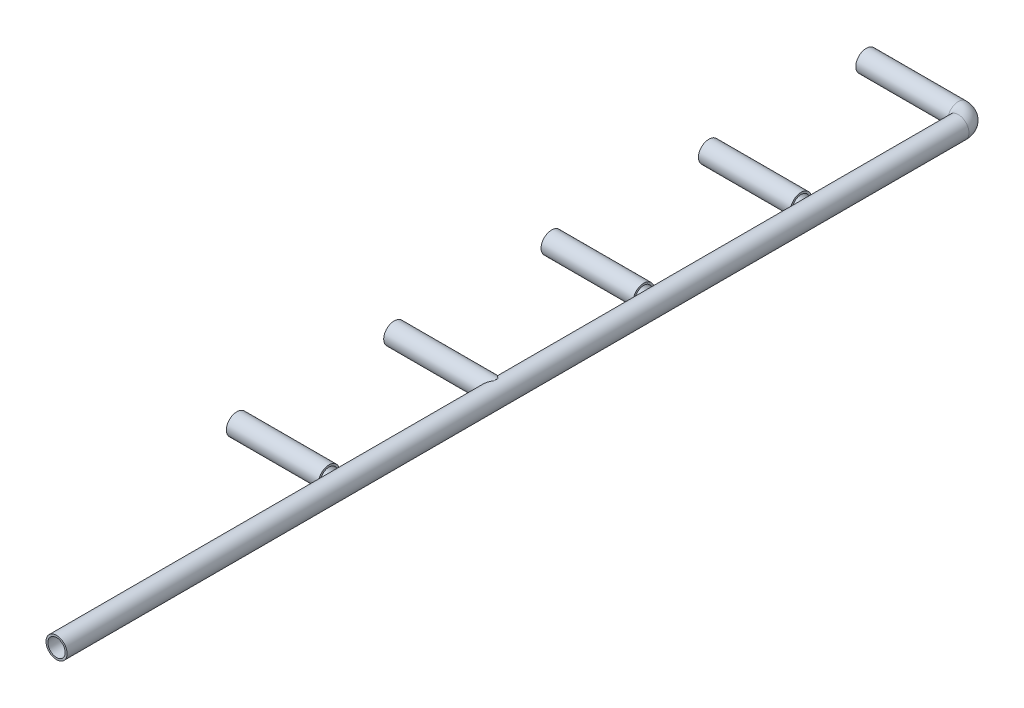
ISO-10303-21;
HEADER;
FILE_DESCRIPTION(('STEP AP214'),'2;1');
FILE_NAME('part.step','',(''),(''),'','','');
FILE_SCHEMA(('AUTOMOTIVE_DESIGN { 1 0 10303 214 1 1 1 1 }'));
ENDSEC;
DATA;
#1=APPLICATION_CONTEXT('core data for automotive mechanical design processes');
#2=APPLICATION_PROTOCOL_DEFINITION('international standard','automotive_design',2000,#1);
#3=PRODUCT_CONTEXT('',#1,'mechanical');
#4=PRODUCT('Part','Part','',(#3));
#5=PRODUCT_RELATED_PRODUCT_CATEGORY('part','',(#4));
#6=PRODUCT_DEFINITION_FORMATION('','',#4);
#7=PRODUCT_DEFINITION_CONTEXT('part definition',#1,'design');
#8=PRODUCT_DEFINITION('design','',#6,#7);
#9=PRODUCT_DEFINITION_SHAPE('','',#8);
#10=(LENGTH_UNIT() NAMED_UNIT(*) SI_UNIT(.MILLI.,.METRE.));
#11=(NAMED_UNIT(*) PLANE_ANGLE_UNIT() SI_UNIT($,.RADIAN.));
#12=(NAMED_UNIT(*) SI_UNIT($,.STERADIAN.) SOLID_ANGLE_UNIT());
#13=UNCERTAINTY_MEASURE_WITH_UNIT(LENGTH_MEASURE(1.E-05),#10,'distance_accuracy_value','');
#14=(GEOMETRIC_REPRESENTATION_CONTEXT(3) GLOBAL_UNCERTAINTY_ASSIGNED_CONTEXT((#13)) GLOBAL_UNIT_ASSIGNED_CONTEXT((#10,
#11,#12)) REPRESENTATION_CONTEXT('',''));
#15=CARTESIAN_POINT('',(0.,0.,0.));
#16=DIRECTION('',(0.,0.,1.));
#17=DIRECTION('',(1.,0.,0.));
#18=AXIS2_PLACEMENT_3D('',#15,#16,#17);
#19=CARTESIAN_POINT('',(-48.,0.,-82.));
#20=DIRECTION('',(1.,0.,0.));
#21=DIRECTION('',(0.,0.,-1.));
#22=AXIS2_PLACEMENT_3D('',#19,#20,#21);
#23=CYLINDRICAL_SURFACE('',#22,4.5);
#24=CARTESIAN_POINT('',(-48.,0.,-82.));
#25=DIRECTION('',(1.,0.,0.));
#26=DIRECTION('',(0.,0.,-1.));
#27=AXIS2_PLACEMENT_3D('',#24,#25,#26);
#28=CIRCLE('',#27,4.5);
#29=CARTESIAN_POINT('',(-48.,0.,-86.5));
#30=VERTEX_POINT('',#29);
#31=EDGE_CURVE('E51',#30,#30,#28,.T.);
#32=ORIENTED_EDGE('',*,*,#31,.F.);
#33=EDGE_LOOP('',(#32));
#34=FACE_BOUND('',#33,.T.);
#35=CARTESIAN_POINT('',(0.,0.,-82.));
#36=DIRECTION('',(1.,0.,0.));
#37=DIRECTION('',(0.,0.,-1.));
#38=AXIS2_PLACEMENT_3D('',#35,#36,#37);
#39=CIRCLE('',#38,4.5);
#40=CARTESIAN_POINT('',(0.,0.,-86.5));
#41=VERTEX_POINT('',#40);
#42=EDGE_CURVE('E60',#41,#41,#39,.T.);
#43=ORIENTED_EDGE('',*,*,#42,.T.);
#44=EDGE_LOOP('',(#43));
#45=FACE_BOUND('',#44,.T.);
#46=ADVANCED_FACE('F44',(#34,#45),#23,.F.);
#47=CARTESIAN_POINT('',(-48.,0.,-82.));
#48=DIRECTION('',(1.,0.,0.));
#49=DIRECTION('',(0.,0.,-1.));
#50=AXIS2_PLACEMENT_3D('',#47,#48,#49);
#51=CYLINDRICAL_SURFACE('',#50,5.49999999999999);
#52=CARTESIAN_POINT('',(-48.,0.,-82.));
#53=DIRECTION('',(1.,0.,0.));
#54=DIRECTION('',(0.,0.,-1.));
#55=AXIS2_PLACEMENT_3D('',#52,#53,#54);
#56=CIRCLE('',#55,5.49999999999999);
#57=CARTESIAN_POINT('',(-48.,0.,-87.5));
#58=VERTEX_POINT('',#57);
#59=EDGE_CURVE('E11',#58,#58,#56,.T.);
#60=ORIENTED_EDGE('',*,*,#59,.T.);
#61=EDGE_LOOP('',(#60));
#62=FACE_BOUND('',#61,.T.);
#63=CARTESIAN_POINT('',(0.,0.,-82.));
#64=DIRECTION('',(1.,0.,0.));
#65=DIRECTION('',(0.,0.,-1.));
#66=AXIS2_PLACEMENT_3D('',#63,#64,#65);
#67=CIRCLE('',#66,5.49999999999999);
#68=CARTESIAN_POINT('',(0.,0.,-87.5));
#69=VERTEX_POINT('',#68);
#70=EDGE_CURVE('E47',#69,#69,#67,.T.);
#71=ORIENTED_EDGE('',*,*,#70,.F.);
#72=EDGE_LOOP('',(#71));
#73=FACE_BOUND('',#72,.T.);
#74=ADVANCED_FACE('F93',(#62,#73),#51,.T.);
#75=CARTESIAN_POINT('',(-48.,0.,0.));
#76=DIRECTION('',(1.,0.,0.));
#77=DIRECTION('',(0.,0.,-1.));
#78=AXIS2_PLACEMENT_3D('',#75,#76,#77);
#79=PLANE('',#78);
#80=ORIENTED_EDGE('',*,*,#31,.T.);
#81=EDGE_LOOP('',(#80));
#82=FACE_BOUND('',#81,.T.);
#83=ORIENTED_EDGE('',*,*,#59,.F.);
#84=EDGE_LOOP('',(#83));
#85=FACE_BOUND('',#84,.T.);
#86=ADVANCED_FACE('F98',(#82,#85),#79,.F.);
#87=CARTESIAN_POINT('',(0.,0.,-76.0614904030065));
#88=DIRECTION('',(0.,1.,0.));
#89=DIRECTION('',(0.,0.,1.));
#90=AXIS2_PLACEMENT_3D('',#87,#88,#89);
#91=TOROIDAL_SURFACE('',#90,5.93850959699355,4.5);
#92=CARTESIAN_POINT('',(5.93850959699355,0.,-76.0614904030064));
#93=DIRECTION('',(0.,0.,1.));
#94=DIRECTION('',(1.,0.,0.));
#95=AXIS2_PLACEMENT_3D('',#92,#93,#94);
#96=CIRCLE('',#95,4.5);
#97=CARTESIAN_POINT('',(10.4385095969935,0.,-76.0614904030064));
#98=VERTEX_POINT('',#97);
#99=EDGE_CURVE('E67',#98,#98,#96,.T.);
#100=CARTESIAN_POINT('',(0.,0.,-76.0614904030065));
#101=DIRECTION('',(0.,1.,0.));
#102=DIRECTION('',(0.,0.,1.));
#103=AXIS2_PLACEMENT_3D('',#100,#101,#102);
#104=CIRCLE('',#103,10.4385095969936);
#105=EDGE_CURVE('',#98,#41,#104,.T.);
#106=ORIENTED_EDGE('',*,*,#99,.T.);
#107=ORIENTED_EDGE('',*,*,#42,.F.);
#108=ORIENTED_EDGE('',*,*,#105,.T.);
#109=ORIENTED_EDGE('',*,*,#105,.F.);
#110=EDGE_LOOP('',(#106,#108,#107,#109));
#111=FACE_BOUND('',#110,.T.);
#112=ADVANCED_FACE('F88',(#111),#91,.F.);
#113=CARTESIAN_POINT('',(0.,0.,-76.0614904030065));
#114=DIRECTION('',(0.,1.,0.));
#115=DIRECTION('',(0.,0.,1.));
#116=AXIS2_PLACEMENT_3D('',#113,#114,#115);
#117=TOROIDAL_SURFACE('',#116,5.93850959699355,5.49999999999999);
#118=CARTESIAN_POINT('',(5.93850959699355,0.,-76.0614904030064));
#119=DIRECTION('',(0.,0.,1.));
#120=DIRECTION('',(1.,0.,0.));
#121=AXIS2_PLACEMENT_3D('',#118,#119,#120);
#122=CIRCLE('',#121,5.49999999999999);
#123=CARTESIAN_POINT('',(11.4385095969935,0.,-76.0614904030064));
#124=VERTEX_POINT('',#123);
#125=EDGE_CURVE('E57',#124,#124,#122,.T.);
#126=CARTESIAN_POINT('',(0.,0.,-76.0614904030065));
#127=DIRECTION('',(0.,1.,0.));
#128=DIRECTION('',(0.,0.,1.));
#129=AXIS2_PLACEMENT_3D('',#126,#127,#128);
#130=CIRCLE('',#129,11.4385095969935);
#131=EDGE_CURVE('',#124,#69,#130,.T.);
#132=ORIENTED_EDGE('',*,*,#125,.F.);
#133=ORIENTED_EDGE('',*,*,#70,.T.);
#134=ORIENTED_EDGE('',*,*,#131,.T.);
#135=ORIENTED_EDGE('',*,*,#131,.F.);
#136=EDGE_LOOP('',(#132,#134,#133,#135));
#137=FACE_BOUND('',#136,.T.);
#138=ADVANCED_FACE('F79',(#137),#117,.T.);
#139=CARTESIAN_POINT('',(5.93850959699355,0.,393.938509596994));
#140=DIRECTION('',(0.,0.,1.));
#141=DIRECTION('',(1.,0.,0.));
#142=AXIS2_PLACEMENT_3D('',#139,#140,#141);
#143=PLANE('',#142);
#144=CARTESIAN_POINT('',(5.93850959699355,0.,393.938509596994));
#145=DIRECTION('',(0.,0.,1.));
#146=DIRECTION('',(1.,0.,0.));
#147=AXIS2_PLACEMENT_3D('',#144,#145,#146);
#148=CIRCLE('',#147,5.49999999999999);
#149=CARTESIAN_POINT('',(11.4385095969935,0.,393.938509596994));
#150=VERTEX_POINT('',#149);
#151=EDGE_CURVE('E63',#150,#150,#148,.T.);
#152=ORIENTED_EDGE('',*,*,#151,.T.);
#153=EDGE_LOOP('',(#152));
#154=FACE_BOUND('',#153,.T.);
#155=CARTESIAN_POINT('',(5.93850959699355,0.,393.938509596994));
#156=DIRECTION('',(0.,0.,1.));
#157=DIRECTION('',(1.,0.,0.));
#158=AXIS2_PLACEMENT_3D('',#155,#156,#157);
#159=CIRCLE('',#158,4.5);
#160=CARTESIAN_POINT('',(10.4385095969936,0.,393.938509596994));
#161=VERTEX_POINT('',#160);
#162=EDGE_CURVE('E66',#161,#161,#159,.T.);
#163=ORIENTED_EDGE('',*,*,#162,.F.);
#164=EDGE_LOOP('',(#163));
#165=FACE_BOUND('',#164,.T.);
#166=ADVANCED_FACE('F76',(#154,#165),#143,.T.);
#167=CARTESIAN_POINT('',(5.93850959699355,0.,393.938509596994));
#168=DIRECTION('',(0.,0.,-1.));
#169=DIRECTION('',(-1.,0.,0.));
#170=AXIS2_PLACEMENT_3D('',#167,#168,#169);
#171=CYLINDRICAL_SURFACE('',#170,5.49999999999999);
#172=ORIENTED_EDGE('',*,*,#151,.F.);
#173=EDGE_LOOP('',(#172));
#174=FACE_BOUND('',#173,.T.);
#175=ORIENTED_EDGE('',*,*,#125,.T.);
#176=EDGE_LOOP('',(#175));
#177=FACE_BOUND('',#176,.T.);
#178=ADVANCED_FACE('F78',(#174,#177),#171,.T.);
#179=CARTESIAN_POINT('',(5.93850959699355,0.,393.938509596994));
#180=DIRECTION('',(0.,0.,-1.));
#181=DIRECTION('',(-1.,0.,0.));
#182=AXIS2_PLACEMENT_3D('',#179,#180,#181);
#183=CYLINDRICAL_SURFACE('',#182,4.5);
#184=ORIENTED_EDGE('',*,*,#162,.T.);
#185=EDGE_LOOP('',(#184));
#186=FACE_BOUND('',#185,.T.);
#187=ORIENTED_EDGE('',*,*,#99,.F.);
#188=EDGE_LOOP('',(#187));
#189=FACE_BOUND('',#188,.T.);
#190=ADVANCED_FACE('F73',(#186,#189),#183,.F.);
#191=CLOSED_SHELL('',(#46,#74,#86,#112,#138,#166,#178,#190));
#192=MANIFOLD_SOLID_BREP('B2',#191);
#193=CARTESIAN_POINT('',(-48.,0.,0.));
#194=DIRECTION('',(1.,0.,0.));
#195=DIRECTION('',(0.,0.,-1.));
#196=AXIS2_PLACEMENT_3D('',#193,#194,#195);
#197=CYLINDRICAL_SURFACE('',#196,4.5);
#198=CARTESIAN_POINT('',(0.,0.,0.));
#199=DIRECTION('',(1.,0.,0.));
#200=DIRECTION('',(0.,0.,-1.));
#201=AXIS2_PLACEMENT_3D('',#198,#199,#200);
#202=CIRCLE('',#201,4.5);
#203=CARTESIAN_POINT('',(0.,0.,-4.5));
#204=VERTEX_POINT('',#203);
#205=EDGE_CURVE('E187',#204,#204,#202,.T.);
#206=ORIENTED_EDGE('',*,*,#205,.T.);
#207=EDGE_LOOP('',(#206));
#208=FACE_BOUND('',#207,.T.);
#209=CARTESIAN_POINT('',(-48.,0.,0.));
#210=DIRECTION('',(1.,0.,0.));
#211=DIRECTION('',(0.,0.,-1.));
#212=AXIS2_PLACEMENT_3D('',#209,#210,#211);
#213=CIRCLE('',#212,4.5);
#214=CARTESIAN_POINT('',(-48.,0.,-4.5));
#215=VERTEX_POINT('',#214);
#216=EDGE_CURVE('E181',#215,#215,#213,.T.);
#217=ORIENTED_EDGE('',*,*,#216,.F.);
#218=EDGE_LOOP('',(#217));
#219=FACE_BOUND('',#218,.T.);
#220=ADVANCED_FACE('F174',(#208,#219),#197,.F.);
#221=CARTESIAN_POINT('',(-48.,0.,0.));
#222=DIRECTION('',(1.,0.,0.));
#223=DIRECTION('',(0.,0.,-1.));
#224=AXIS2_PLACEMENT_3D('',#221,#222,#223);
#225=CYLINDRICAL_SURFACE('',#224,5.5);
#226=CARTESIAN_POINT('',(0.,0.,0.));
#227=DIRECTION('',(1.,0.,0.));
#228=DIRECTION('',(0.,0.,-1.));
#229=AXIS2_PLACEMENT_3D('',#226,#227,#228);
#230=CIRCLE('',#229,5.5);
#231=CARTESIAN_POINT('',(0.,0.,-5.5));
#232=VERTEX_POINT('',#231);
#233=EDGE_CURVE('E177',#232,#232,#230,.T.);
#234=ORIENTED_EDGE('',*,*,#233,.F.);
#235=EDGE_LOOP('',(#234));
#236=FACE_BOUND('',#235,.T.);
#237=CARTESIAN_POINT('',(-48.,0.,0.));
#238=DIRECTION('',(1.,0.,0.));
#239=DIRECTION('',(0.,0.,-1.));
#240=AXIS2_PLACEMENT_3D('',#237,#238,#239);
#241=CIRCLE('',#240,5.5);
#242=CARTESIAN_POINT('',(-48.,0.,-5.5));
#243=VERTEX_POINT('',#242);
#244=EDGE_CURVE('E43',#243,#243,#241,.T.);
#245=ORIENTED_EDGE('',*,*,#244,.T.);
#246=EDGE_LOOP('',(#245));
#247=FACE_BOUND('',#246,.T.);
#248=ADVANCED_FACE('F196',(#236,#247),#225,.T.);
#249=CARTESIAN_POINT('',(-48.,0.,0.));
#250=DIRECTION('',(1.,0.,0.));
#251=DIRECTION('',(0.,0.,-1.));
#252=AXIS2_PLACEMENT_3D('',#249,#250,#251);
#253=PLANE('',#252);
#254=ORIENTED_EDGE('',*,*,#216,.T.);
#255=EDGE_LOOP('',(#254));
#256=FACE_BOUND('',#255,.T.);
#257=ORIENTED_EDGE('',*,*,#244,.F.);
#258=EDGE_LOOP('',(#257));
#259=FACE_BOUND('',#258,.T.);
#260=ADVANCED_FACE('F198',(#256,#259),#253,.F.);
#261=CARTESIAN_POINT('',(0.,0.,0.));
#262=DIRECTION('',(1.,0.,0.));
#263=DIRECTION('',(0.,0.,-1.));
#264=AXIS2_PLACEMENT_3D('',#261,#262,#263);
#265=PLANE('',#264);
#266=ORIENTED_EDGE('',*,*,#205,.F.);
#267=EDGE_LOOP('',(#266));
#268=FACE_BOUND('',#267,.T.);
#269=ORIENTED_EDGE('',*,*,#233,.T.);
#270=EDGE_LOOP('',(#269));
#271=FACE_BOUND('',#270,.T.);
#272=ADVANCED_FACE('F194',(#268,#271),#265,.T.);
#273=CLOSED_SHELL('',(#220,#248,#260,#272));
#274=MANIFOLD_SOLID_BREP('B6',#273);
#275=CARTESIAN_POINT('',(-48.,0.,82.));
#276=DIRECTION('',(1.,0.,0.));
#277=DIRECTION('',(0.,0.,-1.));
#278=AXIS2_PLACEMENT_3D('',#275,#276,#277);
#279=CYLINDRICAL_SURFACE('',#278,4.5);
#280=CARTESIAN_POINT('',(0.,0.,82.));
#281=DIRECTION('',(1.,0.,0.));
#282=DIRECTION('',(0.,0.,-1.));
#283=AXIS2_PLACEMENT_3D('',#280,#281,#282);
#284=CIRCLE('',#283,4.5);
#285=CARTESIAN_POINT('',(0.,0.,77.5));
#286=VERTEX_POINT('',#285);
#287=EDGE_CURVE('E260',#286,#286,#284,.T.);
#288=ORIENTED_EDGE('',*,*,#287,.T.);
#289=EDGE_LOOP('',(#288));
#290=FACE_BOUND('',#289,.T.);
#291=CARTESIAN_POINT('',(-48.,0.,82.));
#292=DIRECTION('',(1.,0.,0.));
#293=DIRECTION('',(0.,0.,-1.));
#294=AXIS2_PLACEMENT_3D('',#291,#292,#293);
#295=CIRCLE('',#294,4.5);
#296=CARTESIAN_POINT('',(-48.,0.,77.5));
#297=VERTEX_POINT('',#296);
#298=EDGE_CURVE('E254',#297,#297,#295,.T.);
#299=ORIENTED_EDGE('',*,*,#298,.F.);
#300=EDGE_LOOP('',(#299));
#301=FACE_BOUND('',#300,.T.);
#302=ADVANCED_FACE('F247',(#290,#301),#279,.F.);
#303=CARTESIAN_POINT('',(-48.,0.,82.));
#304=DIRECTION('',(1.,0.,0.));
#305=DIRECTION('',(0.,0.,-1.));
#306=AXIS2_PLACEMENT_3D('',#303,#304,#305);
#307=CYLINDRICAL_SURFACE('',#306,5.49999999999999);
#308=CARTESIAN_POINT('',(0.,0.,82.));
#309=DIRECTION('',(1.,0.,0.));
#310=DIRECTION('',(0.,0.,-1.));
#311=AXIS2_PLACEMENT_3D('',#308,#309,#310);
#312=CIRCLE('',#311,5.49999999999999);
#313=CARTESIAN_POINT('',(0.,0.,76.5));
#314=VERTEX_POINT('',#313);
#315=EDGE_CURVE('E250',#314,#314,#312,.T.);
#316=ORIENTED_EDGE('',*,*,#315,.F.);
#317=EDGE_LOOP('',(#316));
#318=FACE_BOUND('',#317,.T.);
#319=CARTESIAN_POINT('',(-48.,0.,82.));
#320=DIRECTION('',(1.,0.,0.));
#321=DIRECTION('',(0.,0.,-1.));
#322=AXIS2_PLACEMENT_3D('',#319,#320,#321);
#323=CIRCLE('',#322,5.49999999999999);
#324=CARTESIAN_POINT('',(-48.,0.,76.5));
#325=VERTEX_POINT('',#324);
#326=EDGE_CURVE('E173',#325,#325,#323,.T.);
#327=ORIENTED_EDGE('',*,*,#326,.T.);
#328=EDGE_LOOP('',(#327));
#329=FACE_BOUND('',#328,.T.);
#330=ADVANCED_FACE('F269',(#318,#329),#307,.T.);
#331=CARTESIAN_POINT('',(-48.,0.,0.));
#332=DIRECTION('',(1.,0.,0.));
#333=DIRECTION('',(0.,0.,-1.));
#334=AXIS2_PLACEMENT_3D('',#331,#332,#333);
#335=PLANE('',#334);
#336=ORIENTED_EDGE('',*,*,#298,.T.);
#337=EDGE_LOOP('',(#336));
#338=FACE_BOUND('',#337,.T.);
#339=ORIENTED_EDGE('',*,*,#326,.F.);
#340=EDGE_LOOP('',(#339));
#341=FACE_BOUND('',#340,.T.);
#342=ADVANCED_FACE('F271',(#338,#341),#335,.F.);
#343=CARTESIAN_POINT('',(0.,0.,0.));
#344=DIRECTION('',(1.,0.,0.));
#345=DIRECTION('',(0.,0.,-1.));
#346=AXIS2_PLACEMENT_3D('',#343,#344,#345);
#347=PLANE('',#346);
#348=ORIENTED_EDGE('',*,*,#287,.F.);
#349=EDGE_LOOP('',(#348));
#350=FACE_BOUND('',#349,.T.);
#351=ORIENTED_EDGE('',*,*,#315,.T.);
#352=EDGE_LOOP('',(#351));
#353=FACE_BOUND('',#352,.T.);
#354=ADVANCED_FACE('F267',(#350,#353),#347,.T.);
#355=CLOSED_SHELL('',(#302,#330,#342,#354));
#356=MANIFOLD_SOLID_BREP('B38',#355);
#357=CARTESIAN_POINT('',(-48.,0.,164.));
#358=DIRECTION('',(1.,0.,0.));
#359=DIRECTION('',(0.,0.,-1.));
#360=AXIS2_PLACEMENT_3D('',#357,#358,#359);
#361=CYLINDRICAL_SURFACE('',#360,4.49999999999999);
#362=CARTESIAN_POINT('',(-48.,0.,164.));
#363=DIRECTION('',(1.,0.,0.));
#364=DIRECTION('',(0.,0.,-1.));
#365=AXIS2_PLACEMENT_3D('',#362,#363,#364);
#366=CIRCLE('',#365,4.49999999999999);
#367=CARTESIAN_POINT('',(-48.,0.,159.5));
#368=VERTEX_POINT('',#367);
#369=EDGE_CURVE('E322',#368,#368,#366,.T.);
#370=ORIENTED_EDGE('',*,*,#369,.F.);
#371=EDGE_LOOP('',(#370));
#372=FACE_BOUND('',#371,.T.);
#373=CARTESIAN_POINT('',(5.,0.,164.));
#374=DIRECTION('',(1.,0.,0.));
#375=DIRECTION('',(0.,0.,-1.));
#376=AXIS2_PLACEMENT_3D('',#373,#374,#375);
#377=CIRCLE('',#376,4.49999999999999);
#378=CARTESIAN_POINT('',(5.,0.,159.5));
#379=VERTEX_POINT('',#378);
#380=EDGE_CURVE('E326',#379,#379,#377,.F.);
#381=ORIENTED_EDGE('',*,*,#380,.F.);
#382=EDGE_LOOP('',(#381));
#383=FACE_BOUND('',#382,.T.);
#384=ADVANCED_FACE('F316',(#372,#383),#361,.F.);
#385=CARTESIAN_POINT('',(-48.,0.,164.));
#386=DIRECTION('',(1.,0.,0.));
#387=DIRECTION('',(0.,0.,-1.));
#388=AXIS2_PLACEMENT_3D('',#385,#386,#387);
#389=CYLINDRICAL_SURFACE('',#388,5.50000000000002);
#390=CARTESIAN_POINT('',(-48.,0.,164.));
#391=DIRECTION('',(1.,0.,0.));
#392=DIRECTION('',(0.,0.,-1.));
#393=AXIS2_PLACEMENT_3D('',#390,#391,#392);
#394=CIRCLE('',#393,5.50000000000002);
#395=CARTESIAN_POINT('',(-48.,0.,158.5));
#396=VERTEX_POINT('',#395);
#397=EDGE_CURVE('E246',#396,#396,#394,.T.);
#398=ORIENTED_EDGE('',*,*,#397,.T.);
#399=EDGE_LOOP('',(#398));
#400=FACE_BOUND('',#399,.T.);
#401=CARTESIAN_POINT('',(5.,0.,164.));
#402=DIRECTION('',(1.,0.,0.));
#403=DIRECTION('',(0.,0.,-1.));
#404=AXIS2_PLACEMENT_3D('',#401,#402,#403);
#405=CIRCLE('',#404,5.50000000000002);
#406=CARTESIAN_POINT('',(5.,0.,158.5));
#407=VERTEX_POINT('',#406);
#408=EDGE_CURVE('E330',#407,#407,#405,.T.);
#409=ORIENTED_EDGE('',*,*,#408,.F.);
#410=EDGE_LOOP('',(#409));
#411=FACE_BOUND('',#410,.T.);
#412=ADVANCED_FACE('F339',(#400,#411),#389,.T.);
#413=CARTESIAN_POINT('',(-48.,0.,0.));
#414=DIRECTION('',(1.,0.,0.));
#415=DIRECTION('',(0.,0.,-1.));
#416=AXIS2_PLACEMENT_3D('',#413,#414,#415);
#417=PLANE('',#416);
#418=ORIENTED_EDGE('',*,*,#369,.T.);
#419=EDGE_LOOP('',(#418));
#420=FACE_BOUND('',#419,.T.);
#421=ORIENTED_EDGE('',*,*,#397,.F.);
#422=EDGE_LOOP('',(#421));
#423=FACE_BOUND('',#422,.T.);
#424=ADVANCED_FACE('F341',(#420,#423),#417,.F.);
#425=CARTESIAN_POINT('',(5.,0.,0.));
#426=DIRECTION('',(1.,0.,0.));
#427=DIRECTION('',(0.,0.,-1.));
#428=AXIS2_PLACEMENT_3D('',#425,#426,#427);
#429=PLANE('',#428);
#430=ORIENTED_EDGE('',*,*,#408,.T.);
#431=EDGE_LOOP('',(#430));
#432=FACE_BOUND('',#431,.T.);
#433=ORIENTED_EDGE('',*,*,#380,.T.);
#434=EDGE_LOOP('',(#433));
#435=FACE_BOUND('',#434,.T.);
#436=ADVANCED_FACE('F336',(#432,#435),#429,.T.);
#437=CLOSED_SHELL('',(#384,#412,#424,#436));
#438=MANIFOLD_SOLID_BREP('B168',#437);
#439=CARTESIAN_POINT('',(-48.,0.,246.));
#440=DIRECTION('',(1.,0.,0.));
#441=DIRECTION('',(0.,0.,-1.));
#442=AXIS2_PLACEMENT_3D('',#439,#440,#441);
#443=CYLINDRICAL_SURFACE('',#442,4.49999999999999);
#444=CARTESIAN_POINT('',(0.,0.,246.));
#445=DIRECTION('',(1.,0.,0.));
#446=DIRECTION('',(0.,0.,-1.));
#447=AXIS2_PLACEMENT_3D('',#444,#445,#446);
#448=CIRCLE('',#447,4.49999999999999);
#449=CARTESIAN_POINT('',(0.,0.,241.5));
#450=VERTEX_POINT('',#449);
#451=EDGE_CURVE('E408',#450,#450,#448,.T.);
#452=ORIENTED_EDGE('',*,*,#451,.T.);
#453=EDGE_LOOP('',(#452));
#454=FACE_BOUND('',#453,.T.);
#455=CARTESIAN_POINT('',(-48.,0.,246.));
#456=DIRECTION('',(1.,0.,0.));
#457=DIRECTION('',(0.,0.,-1.));
#458=AXIS2_PLACEMENT_3D('',#455,#456,#457);
#459=CIRCLE('',#458,4.49999999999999);
#460=CARTESIAN_POINT('',(-48.,0.,241.5));
#461=VERTEX_POINT('',#460);
#462=EDGE_CURVE('E402',#461,#461,#459,.T.);
#463=ORIENTED_EDGE('',*,*,#462,.F.);
#464=EDGE_LOOP('',(#463));
#465=FACE_BOUND('',#464,.T.);
#466=ADVANCED_FACE('F395',(#454,#465),#443,.F.);
#467=CARTESIAN_POINT('',(-48.,0.,246.));
#468=DIRECTION('',(1.,0.,0.));
#469=DIRECTION('',(0.,0.,-1.));
#470=AXIS2_PLACEMENT_3D('',#467,#468,#469);
#471=CYLINDRICAL_SURFACE('',#470,5.50000000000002);
#472=CARTESIAN_POINT('',(0.,0.,246.));
#473=DIRECTION('',(1.,0.,0.));
#474=DIRECTION('',(0.,0.,-1.));
#475=AXIS2_PLACEMENT_3D('',#472,#473,#474);
#476=CIRCLE('',#475,5.50000000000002);
#477=CARTESIAN_POINT('',(0.,0.,240.5));
#478=VERTEX_POINT('',#477);
#479=EDGE_CURVE('E398',#478,#478,#476,.T.);
#480=ORIENTED_EDGE('',*,*,#479,.F.);
#481=EDGE_LOOP('',(#480));
#482=FACE_BOUND('',#481,.T.);
#483=CARTESIAN_POINT('',(-48.,0.,246.));
#484=DIRECTION('',(1.,0.,0.));
#485=DIRECTION('',(0.,0.,-1.));
#486=AXIS2_PLACEMENT_3D('',#483,#484,#485);
#487=CIRCLE('',#486,5.50000000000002);
#488=CARTESIAN_POINT('',(-48.,0.,240.5));
#489=VERTEX_POINT('',#488);
#490=EDGE_CURVE('E315',#489,#489,#487,.T.);
#491=ORIENTED_EDGE('',*,*,#490,.T.);
#492=EDGE_LOOP('',(#491));
#493=FACE_BOUND('',#492,.T.);
#494=ADVANCED_FACE('F417',(#482,#493),#471,.T.);
#495=CARTESIAN_POINT('',(-48.,0.,0.));
#496=DIRECTION('',(1.,0.,0.));
#497=DIRECTION('',(0.,0.,-1.));
#498=AXIS2_PLACEMENT_3D('',#495,#496,#497);
#499=PLANE('',#498);
#500=ORIENTED_EDGE('',*,*,#462,.T.);
#501=EDGE_LOOP('',(#500));
#502=FACE_BOUND('',#501,.T.);
#503=ORIENTED_EDGE('',*,*,#490,.F.);
#504=EDGE_LOOP('',(#503));
#505=FACE_BOUND('',#504,.T.);
#506=ADVANCED_FACE('F419',(#502,#505),#499,.F.);
#507=CARTESIAN_POINT('',(0.,0.,0.));
#508=DIRECTION('',(1.,0.,0.));
#509=DIRECTION('',(0.,0.,-1.));
#510=AXIS2_PLACEMENT_3D('',#507,#508,#509);
#511=PLANE('',#510);
#512=ORIENTED_EDGE('',*,*,#451,.F.);
#513=EDGE_LOOP('',(#512));
#514=FACE_BOUND('',#513,.T.);
#515=ORIENTED_EDGE('',*,*,#479,.T.);
#516=EDGE_LOOP('',(#515));
#517=FACE_BOUND('',#516,.T.);
#518=ADVANCED_FACE('F415',(#514,#517),#511,.T.);
#519=CLOSED_SHELL('',(#466,#494,#506,#518));
#520=MANIFOLD_SOLID_BREP('B241',#519);
#521=ADVANCED_BREP_SHAPE_REPRESENTATION('',(#18,#192,#274,#356,#438,#520),#14);
#522=SHAPE_DEFINITION_REPRESENTATION(#9,#521);
ENDSEC;
END-ISO-10303-21;
